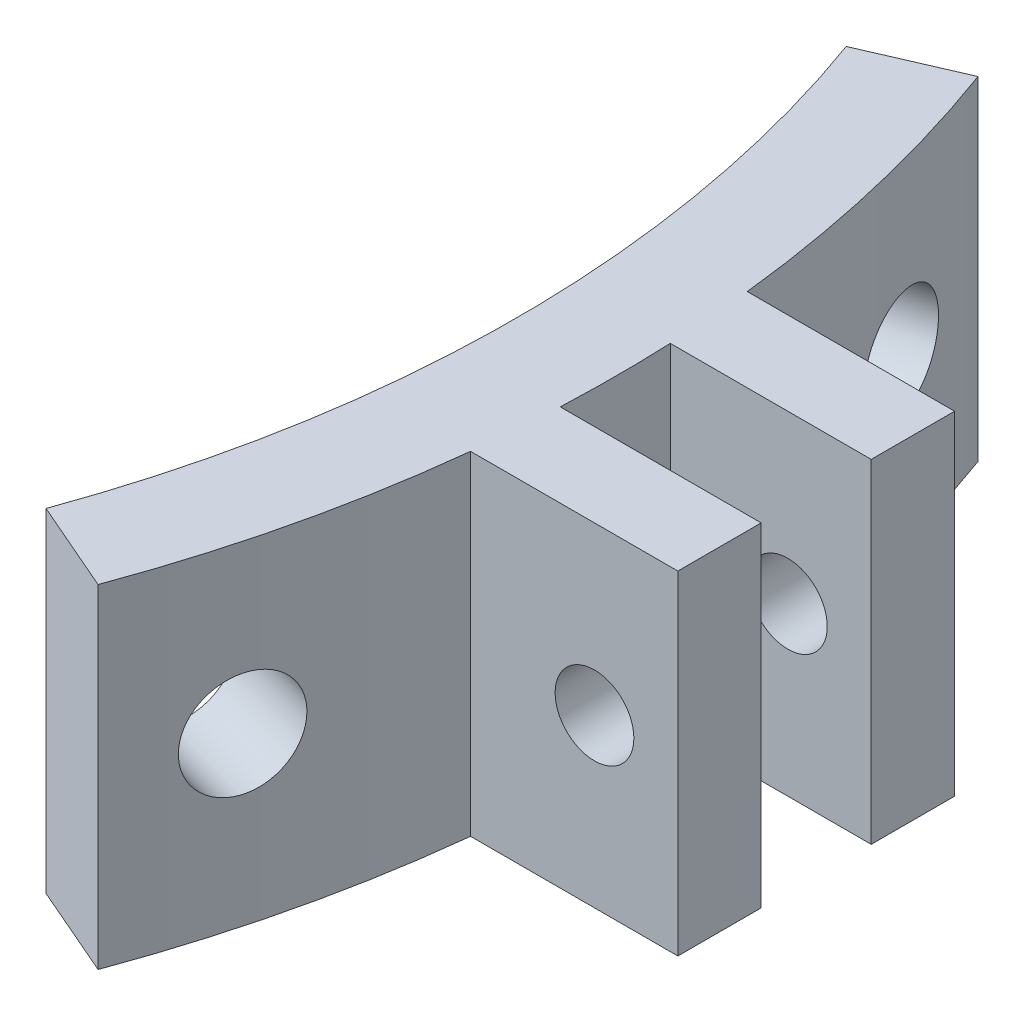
ISO-10303-21;
HEADER;
FILE_DESCRIPTION(('STEP AP214'),'2;1');
FILE_NAME('part.step','',(''),(''),'','','');
FILE_SCHEMA(('AUTOMOTIVE_DESIGN { 1 0 10303 214 1 1 1 1 }'));
ENDSEC;
DATA;
#1=APPLICATION_CONTEXT('core data for automotive mechanical design processes');
#2=APPLICATION_PROTOCOL_DEFINITION('international standard','automotive_design',2000,#1);
#3=PRODUCT_CONTEXT('',#1,'mechanical');
#4=PRODUCT('Part','Part','',(#3));
#5=PRODUCT_RELATED_PRODUCT_CATEGORY('part','',(#4));
#6=PRODUCT_DEFINITION_FORMATION('','',#4);
#7=PRODUCT_DEFINITION_CONTEXT('part definition',#1,'design');
#8=PRODUCT_DEFINITION('design','',#6,#7);
#9=PRODUCT_DEFINITION_SHAPE('','',#8);
#10=(LENGTH_UNIT() NAMED_UNIT(*) SI_UNIT(.MILLI.,.METRE.));
#11=(NAMED_UNIT(*) PLANE_ANGLE_UNIT() SI_UNIT($,.RADIAN.));
#12=(NAMED_UNIT(*) SI_UNIT($,.STERADIAN.) SOLID_ANGLE_UNIT());
#13=UNCERTAINTY_MEASURE_WITH_UNIT(LENGTH_MEASURE(1.E-05),#10,'distance_accuracy_value','');
#14=(GEOMETRIC_REPRESENTATION_CONTEXT(3) GLOBAL_UNCERTAINTY_ASSIGNED_CONTEXT((#13)) GLOBAL_UNIT_ASSIGNED_CONTEXT((#10,
#11,#12)) REPRESENTATION_CONTEXT('',''));
#15=CARTESIAN_POINT('',(0.,0.,0.));
#16=DIRECTION('',(0.,0.,1.));
#17=DIRECTION('',(1.,0.,0.));
#18=AXIS2_PLACEMENT_3D('',#15,#16,#17);
#19=CARTESIAN_POINT('',(0.,6.35,0.));
#20=DIRECTION('',(0.,-1.,0.));
#21=DIRECTION('',(0.,0.,-1.));
#22=AXIS2_PLACEMENT_3D('',#19,#20,#21);
#23=CYLINDRICAL_SURFACE('',#22,48.514);
#24=CARTESIAN_POINT('',(0.,-6.35,0.));
#25=DIRECTION('',(0.,1.,0.));
#26=DIRECTION('',(0.,0.,1.));
#27=AXIS2_PLACEMENT_3D('',#24,#25,#26);
#28=CIRCLE('',#27,48.514);
#29=CARTESIAN_POINT('',(48.2268600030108,-6.35,-5.2705));
#30=VERTEX_POINT('',#29);
#31=CARTESIAN_POINT('',(45.5277840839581,-6.35,-16.7579554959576));
#32=VERTEX_POINT('',#31);
#33=EDGE_CURVE('E155',#30,#32,#28,.T.);
#34=ORIENTED_EDGE('',*,*,#33,.T.);
#35=DIRECTION('',(0.,-1.,0.));
#36=VECTOR('',#35,1.);
#37=CARTESIAN_POINT('',(45.5277840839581,6.35,-16.7579554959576));
#38=LINE('',#37,#36);
#39=CARTESIAN_POINT('',(45.5277840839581,6.35,-16.7579554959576));
#40=VERTEX_POINT('',#39);
#41=EDGE_CURVE('E168',#32,#40,#38,.F.);
#42=ORIENTED_EDGE('',*,*,#41,.T.);
#43=CARTESIAN_POINT('',(0.,6.35,0.));
#44=DIRECTION('',(0.,1.,0.));
#45=DIRECTION('',(0.,0.,1.));
#46=AXIS2_PLACEMENT_3D('',#43,#44,#45);
#47=CIRCLE('',#46,48.514);
#48=CARTESIAN_POINT('',(48.2268600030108,6.35,-5.2705));
#49=VERTEX_POINT('',#48);
#50=EDGE_CURVE('E50',#49,#40,#47,.T.);
#51=ORIENTED_EDGE('',*,*,#50,.F.);
#52=DIRECTION('',(0.,-1.,0.));
#53=VECTOR('',#52,1.);
#54=CARTESIAN_POINT('',(48.2268600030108,6.35,-5.2705));
#55=LINE('',#54,#53);
#56=EDGE_CURVE('E170',#49,#30,#55,.T.);
#57=ORIENTED_EDGE('',*,*,#56,.T.);
#58=EDGE_LOOP('',(#34,#42,#51,#57));
#59=FACE_BOUND('',#58,.T.);
#60=CARTESIAN_POINT('',(46.3034500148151,0.,-14.4775243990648));
#61=CARTESIAN_POINT('',(46.3034518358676,0.11228965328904,-14.4775197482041));
#62=CARTESIAN_POINT('',(46.3062867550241,0.224659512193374,-14.468461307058));
#63=CARTESIAN_POINT('',(46.3175245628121,0.446300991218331,-14.4324445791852));
#64=CARTESIAN_POINT('',(46.3259340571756,0.555568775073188,-14.405465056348));
#65=CARTESIAN_POINT('',(46.3479868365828,0.767763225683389,-14.334353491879));
#66=CARTESIAN_POINT('',(46.3616275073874,0.87069303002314,-14.2902300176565));
#67=CARTESIAN_POINT('',(46.3936086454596,1.06731627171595,-14.1860574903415));
#68=CARTESIAN_POINT('',(46.4119479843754,1.16101191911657,-14.1260122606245));
#69=CARTESIAN_POINT('',(46.4526441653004,1.33660431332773,-13.9916033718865));
#70=CARTESIAN_POINT('',(46.4750035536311,1.41849352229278,-13.9172306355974));
#71=CARTESIAN_POINT('',(46.5229082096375,1.56808451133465,-13.7562438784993));
#72=CARTESIAN_POINT('',(46.5484536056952,1.63578571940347,-13.6696293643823));
#73=CARTESIAN_POINT('',(46.6018312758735,1.75509683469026,-13.4865340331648));
#74=CARTESIAN_POINT('',(46.6296643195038,1.80670129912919,-13.3900498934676));
#75=CARTESIAN_POINT('',(46.6866641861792,1.89231900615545,-13.1899354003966));
#76=CARTESIAN_POINT('',(46.7158310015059,1.92633235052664,-13.086305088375));
#77=CARTESIAN_POINT('',(46.7745427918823,1.97578356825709,-12.8748734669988));
#78=CARTESIAN_POINT('',(46.80408754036,1.99123208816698,-12.7670745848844));
#79=CARTESIAN_POINT('',(46.8626800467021,2.00314796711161,-12.5502995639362));
#80=CARTESIAN_POINT('',(46.8917278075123,1.99961543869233,-12.4413234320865));
#81=CARTESIAN_POINT('',(46.9484954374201,1.97367838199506,-12.2253602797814));
#82=CARTESIAN_POINT('',(46.9762161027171,1.95128532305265,-12.1183720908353));
#83=CARTESIAN_POINT('',(47.0296365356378,1.88828062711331,-11.9093713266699));
#84=CARTESIAN_POINT('',(47.0553362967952,1.84766893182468,-11.8073587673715));
#85=CARTESIAN_POINT('',(47.1041227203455,1.74936665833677,-11.611203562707));
#86=CARTESIAN_POINT('',(47.1272085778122,1.69167083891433,-11.5170633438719));
#87=CARTESIAN_POINT('',(47.1702728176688,1.56084193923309,-11.3393971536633));
#88=CARTESIAN_POINT('',(47.1902511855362,1.48770878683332,-11.2558712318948));
#89=CARTESIAN_POINT('',(47.226737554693,1.32801632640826,-11.1017901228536));
#90=CARTESIAN_POINT('',(47.2432429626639,1.24144706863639,-11.0312446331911));
#91=CARTESIAN_POINT('',(47.2724852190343,1.05737479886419,-10.9052525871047));
#92=CARTESIAN_POINT('',(47.2852220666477,0.959871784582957,-10.8498060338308));
#93=CARTESIAN_POINT('',(47.3067324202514,0.756693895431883,-10.7556314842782));
#94=CARTESIAN_POINT('',(47.3155058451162,0.651018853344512,-10.7169038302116));
#95=CARTESIAN_POINT('',(47.328965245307,0.434499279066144,-10.657306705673));
#96=CARTESIAN_POINT('',(47.3336512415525,0.323654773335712,-10.6364371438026));
#97=CARTESIAN_POINT('',(47.3388715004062,0.100030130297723,-10.6131798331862));
#98=CARTESIAN_POINT('',(47.339408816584,-0.0127485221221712,-10.6107784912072));
#99=CARTESIAN_POINT('',(47.3363327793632,-0.237116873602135,-10.6244925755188));
#100=CARTESIAN_POINT('',(47.3327194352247,-0.348706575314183,-10.6406079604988));
#101=CARTESIAN_POINT('',(47.3213916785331,-0.56749043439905,-10.6908719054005));
#102=CARTESIAN_POINT('',(47.3136786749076,-0.674686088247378,-10.7250142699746));
#103=CARTESIAN_POINT('',(47.2942590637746,-0.881684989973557,-10.8103264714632));
#104=CARTESIAN_POINT('',(47.2825524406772,-0.981488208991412,-10.8614963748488));
#105=CARTESIAN_POINT('',(47.2553122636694,-1.17093327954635,-10.9794038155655));
#106=CARTESIAN_POINT('',(47.2397764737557,-1.26056914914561,-11.0461504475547));
#107=CARTESIAN_POINT('',(47.2051370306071,-1.42707495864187,-11.1932537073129));
#108=CARTESIAN_POINT('',(47.1860333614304,-1.50394484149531,-11.2736103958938));
#109=CARTESIAN_POINT('',(47.1445955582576,-1.6427832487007,-11.445659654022));
#110=CARTESIAN_POINT('',(47.1222594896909,-1.70474278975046,-11.537359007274));
#111=CARTESIAN_POINT('',(47.0748228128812,-1.81194031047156,-11.7294084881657));
#112=CARTESIAN_POINT('',(47.0497222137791,-1.85717834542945,-11.8297585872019));
#113=CARTESIAN_POINT('',(46.9973364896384,-1.92963296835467,-12.0361906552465));
#114=CARTESIAN_POINT('',(46.9700520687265,-1.95685533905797,-12.142270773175));
#115=CARTESIAN_POINT('',(46.913977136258,-1.99252483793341,-12.357154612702));
#116=CARTESIAN_POINT('',(46.8851866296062,-2.00097202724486,-12.4659583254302));
#117=CARTESIAN_POINT('',(46.8269113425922,-1.9988507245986,-12.6831068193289));
#118=CARTESIAN_POINT('',(46.7974270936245,-1.98829634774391,-12.7914518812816));
#119=CARTESIAN_POINT('',(46.7386163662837,-1.94850063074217,-13.0046981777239));
#120=CARTESIAN_POINT('',(46.7092898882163,-1.91925925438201,-13.1095994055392));
#121=CARTESIAN_POINT('',(46.6517219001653,-1.8429221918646,-13.3130095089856));
#122=CARTESIAN_POINT('',(46.6234804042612,-1.79582627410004,-13.4115183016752));
#123=CARTESIAN_POINT('',(46.5690284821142,-1.68512010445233,-13.599388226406));
#124=CARTESIAN_POINT('',(46.5428179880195,-1.62151040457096,-13.6887496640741));
#125=CARTESIAN_POINT('',(46.4933305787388,-1.47953412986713,-13.8559021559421));
#126=CARTESIAN_POINT('',(46.4700555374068,-1.40115820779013,-13.9336858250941));
#127=CARTESIAN_POINT('',(46.4273036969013,-1.23187120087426,-14.0754810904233));
#128=CARTESIAN_POINT('',(46.4078278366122,-1.14095702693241,-14.1394892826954));
#129=CARTESIAN_POINT('',(46.3734036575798,-0.949120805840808,-14.2519859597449));
#130=CARTESIAN_POINT('',(46.3584589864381,-0.848190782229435,-14.3004619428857));
#131=CARTESIAN_POINT('',(46.3337119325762,-0.639321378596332,-14.3804417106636));
#132=CARTESIAN_POINT('',(46.3239034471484,-0.531390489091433,-14.4119656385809));
#133=CARTESIAN_POINT('',(46.3124035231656,-0.352319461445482,-14.4488644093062));
#134=CARTESIAN_POINT('',(46.3090515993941,-0.282340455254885,-14.4595986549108));
#135=CARTESIAN_POINT('',(46.3045742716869,-0.14158493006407,-14.4739301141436));
#136=CARTESIAN_POINT('',(46.3034488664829,-0.0708084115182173,-14.4775273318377));
#137=CARTESIAN_POINT('',(46.3034500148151,0.,-14.4775243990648));
#138=B_SPLINE_CURVE_WITH_KNOTS('',3,(#60,#61,#62,#63,#64,#65,#66,#67,#68,#69,#70,#71,#72,#73,
#74,#75,#76,#77,#78,#79,#80,#81,#82,#83,#84,#85,#86,#87,#88,#89,#90,#91,#92,#93,#94,#95,#96,#97,
#98,#99,#100,#101,#102,#103,#104,#105,#106,#107,#108,#109,#110,#111,#112,#113,#114,#115,#116,
#117,#118,#119,#120,#121,#122,#123,#124,#125,#126,#127,#128,#129,#130,#131,#132,#133,#134,#135,
#136,#137),.UNSPECIFIED.,.T.,.F.,(4,2,2,2,2,2,2,2,2,2,2,2,2,2,2,2,2,2,2,2,2,2,2,2,2,2,2,2,2,2,2,
2,2,2,2,2,2,2,4),(0.,0.336610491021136,0.673620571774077,1.01046245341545,1.34722352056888,
1.68419865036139,2.02118736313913,2.35828989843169,2.69539048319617,3.03229765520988,
3.36920282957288,3.70590327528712,4.0426047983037,4.37940972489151,4.7162162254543,
5.05327333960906,5.39033052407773,5.72739460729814,6.06445696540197,6.40127121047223,
6.73808470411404,7.07478252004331,7.41148165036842,7.74837786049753,8.08527557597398,
8.42237576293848,8.75947483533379,9.09646565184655,9.43345537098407,9.77019486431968,
10.1069350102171,10.4436795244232,10.7804127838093,11.117359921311,11.4543902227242,
11.791691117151,12.1285903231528,12.3408526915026,12.5531149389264),.UNSPECIFIED.);
#139=CARTESIAN_POINT('',(46.3034500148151,0.,-14.4775243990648));
#140=VERTEX_POINT('',#139);
#141=EDGE_CURVE('E493',#140,#140,#138,.T.);
#142=ORIENTED_EDGE('',*,*,#141,.F.);
#143=EDGE_LOOP('',(#142));
#144=FACE_BOUND('',#143,.T.);
#145=ADVANCED_FACE('F41',(#59,#144),#23,.T.);
#146=CARTESIAN_POINT('',(0.,6.35,0.));
#147=DIRECTION('',(0.,-1.,0.));
#148=DIRECTION('',(0.,0.,-1.));
#149=AXIS2_PLACEMENT_3D('',#146,#147,#148);
#150=CYLINDRICAL_SURFACE('',#149,44.704);
#151=DIRECTION('',(0.,1.,0.));
#152=VECTOR('',#151,1.);
#153=CARTESIAN_POINT('',(42.0260635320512,-6.35,15.24));
#154=LINE('',#153,#152);
#155=CARTESIAN_POINT('',(42.0260635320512,-6.35,15.24));
#156=VERTEX_POINT('',#155);
#157=CARTESIAN_POINT('',(42.0260635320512,6.35,15.24));
#158=VERTEX_POINT('',#157);
#159=EDGE_CURVE('E139',#156,#158,#154,.T.);
#160=ORIENTED_EDGE('',*,*,#159,.T.);
#161=CARTESIAN_POINT('',(0.,6.35,0.));
#162=DIRECTION('',(0.,1.,0.));
#163=DIRECTION('',(0.,0.,1.));
#164=AXIS2_PLACEMENT_3D('',#161,#162,#163);
#165=CIRCLE('',#164,44.704);
#166=CARTESIAN_POINT('',(42.0260635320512,6.35,-15.24));
#167=VERTEX_POINT('',#166);
#168=EDGE_CURVE('E146',#158,#167,#165,.T.);
#169=ORIENTED_EDGE('',*,*,#168,.T.);
#170=DIRECTION('',(0.,1.,0.));
#171=VECTOR('',#170,1.);
#172=CARTESIAN_POINT('',(42.0260635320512,-6.35,-15.24));
#173=LINE('',#172,#171);
#174=CARTESIAN_POINT('',(42.0260635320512,-6.35,-15.24));
#175=VERTEX_POINT('',#174);
#176=EDGE_CURVE('E130',#175,#167,#173,.T.);
#177=ORIENTED_EDGE('',*,*,#176,.F.);
#178=CARTESIAN_POINT('',(0.,-6.35,0.));
#179=DIRECTION('',(0.,1.,0.));
#180=DIRECTION('',(0.,0.,1.));
#181=AXIS2_PLACEMENT_3D('',#178,#179,#180);
#182=CIRCLE('',#181,44.704);
#183=EDGE_CURVE('E153',#156,#175,#182,.T.);
#184=ORIENTED_EDGE('',*,*,#183,.F.);
#185=EDGE_LOOP('',(#160,#169,#177,#184));
#186=FACE_BOUND('',#185,.T.);
#187=CARTESIAN_POINT('',(43.6551502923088,0.,9.62680990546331));
#188=CARTESIAN_POINT('',(43.655149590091,0.112280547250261,9.626814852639));
#189=CARTESIAN_POINT('',(43.6531082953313,0.224641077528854,9.63608435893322));
#190=CARTESIAN_POINT('',(43.644959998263,0.446263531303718,9.67292225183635));
#191=CARTESIAN_POINT('',(43.6388481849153,0.555521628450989,9.70051229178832));
#192=CARTESIAN_POINT('',(43.6226325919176,0.767696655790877,9.77317345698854));
#193=CARTESIAN_POINT('',(43.6125308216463,0.870616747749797,9.81823578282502));
#194=CARTESIAN_POINT('',(43.5884700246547,1.06722248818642,9.92450757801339));
#195=CARTESIAN_POINT('',(43.5745119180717,1.16091033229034,9.9857131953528));
#196=CARTESIAN_POINT('',(43.542929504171,1.33649891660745,10.1225404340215));
#197=CARTESIAN_POINT('',(43.5253025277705,1.41839100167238,10.1981725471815));
#198=CARTESIAN_POINT('',(43.4866794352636,1.56798983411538,10.3616294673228));
#199=CARTESIAN_POINT('',(43.4656831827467,1.6356960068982,10.4494547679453));
#200=CARTESIAN_POINT('',(43.4207078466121,1.75502308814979,10.634793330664));
#201=CARTESIAN_POINT('',(43.3967275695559,1.80663753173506,10.732310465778));
#202=CARTESIAN_POINT('',(43.3463019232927,1.89227443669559,10.9341912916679));
#203=CARTESIAN_POINT('',(43.3198565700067,1.92629701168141,11.0385549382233));
#204=CARTESIAN_POINT('',(43.2651510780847,1.97576229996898,11.2510595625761));
#205=CARTESIAN_POINT('',(43.2368921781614,1.99121755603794,11.3591979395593));
#206=CARTESIAN_POINT('',(43.1792904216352,2.00314818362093,11.5762298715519));
#207=CARTESIAN_POINT('',(43.1499475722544,1.99962368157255,11.6851234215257));
#208=CARTESIAN_POINT('',(43.0910462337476,1.97370528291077,11.9004961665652));
#209=CARTESIAN_POINT('',(43.0614879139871,1.95132489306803,12.0069770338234));
#210=CARTESIAN_POINT('',(43.0030538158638,1.88835094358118,12.2146067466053));
#211=CARTESIAN_POINT('',(42.9741780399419,1.84775731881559,12.3157555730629));
#212=CARTESIAN_POINT('',(42.9180558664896,1.74949376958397,12.5099290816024));
#213=CARTESIAN_POINT('',(42.8908100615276,1.69181767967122,12.6029508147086));
#214=CARTESIAN_POINT('',(42.8389121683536,1.56103092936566,12.7782467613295));
#215=CARTESIAN_POINT('',(42.8142600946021,1.48792018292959,12.8605209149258));
#216=CARTESIAN_POINT('',(42.7684314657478,1.3282630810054,13.0121165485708));
#217=CARTESIAN_POINT('',(42.7472579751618,1.24170500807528,13.0814266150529));
#218=CARTESIAN_POINT('',(42.7092180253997,1.05765152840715,13.2050941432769));
#219=CARTESIAN_POINT('',(42.6923515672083,0.96015611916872,13.2594516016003));
#220=CARTESIAN_POINT('',(42.6635860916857,0.756988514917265,13.3517184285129));
#221=CARTESIAN_POINT('',(42.6516871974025,0.651316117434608,13.3896273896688));
#222=CARTESIAN_POINT('',(42.6333342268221,0.434797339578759,13.4479504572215));
#223=CARTESIAN_POINT('',(42.6268801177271,0.323950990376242,13.468364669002));
#224=CARTESIAN_POINT('',(42.6196819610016,0.100333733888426,13.4911256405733));
#225=CARTESIAN_POINT('',(42.618932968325,-0.0124354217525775,13.4934880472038));
#226=CARTESIAN_POINT('',(42.6231625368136,-0.236787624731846,13.4801216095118));
#227=CARTESIAN_POINT('',(42.628141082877,-0.348370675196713,13.4643928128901));
#228=CARTESIAN_POINT('',(42.6436201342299,-0.56713728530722,13.4152872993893));
#229=CARTESIAN_POINT('',(42.6541184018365,-0.674322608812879,13.3819177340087));
#230=CARTESIAN_POINT('',(42.6802141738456,-0.881305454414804,13.2984523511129));
#231=CARTESIAN_POINT('',(42.6958117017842,-0.981102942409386,13.248356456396));
#232=CARTESIAN_POINT('',(42.7315047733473,-1.17055268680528,13.1327743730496));
#233=CARTESIAN_POINT('',(42.7516034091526,-1.26019790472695,13.0672776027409));
#234=CARTESIAN_POINT('',(42.7955226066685,-1.42672764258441,12.9227145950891));
#235=CARTESIAN_POINT('',(42.8193431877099,-1.50361209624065,12.8436482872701));
#236=CARTESIAN_POINT('',(42.8698430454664,-1.64249281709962,12.6740676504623));
#237=CARTESIAN_POINT('',(42.8965243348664,-1.7044785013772,12.5835452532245));
#238=CARTESIAN_POINT('',(42.9517844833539,-1.81172980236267,12.3936110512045));
#239=CARTESIAN_POINT('',(42.980363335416,-1.85699548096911,12.294199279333));
#240=CARTESIAN_POINT('',(43.0384437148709,-1.92950331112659,12.0893053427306));
#241=CARTESIAN_POINT('',(43.0679448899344,-1.95675225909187,11.9838254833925));
#242=CARTESIAN_POINT('',(43.1269445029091,-1.99247539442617,11.7697322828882));
#243=CARTESIAN_POINT('',(43.1564429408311,-2.00094965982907,11.6611189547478));
#244=CARTESIAN_POINT('',(43.2145413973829,-1.99888209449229,11.4439352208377));
#245=CARTESIAN_POINT('',(43.2431421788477,-1.98835688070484,11.335364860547));
#246=CARTESIAN_POINT('',(43.2986988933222,-1.94862343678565,11.1212646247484));
#247=CARTESIAN_POINT('',(43.3256548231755,-1.91941517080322,11.0157347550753));
#248=CARTESIAN_POINT('',(43.3772613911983,-1.84314794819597,10.8107350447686));
#249=CARTESIAN_POINT('',(43.4019120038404,-1.7960887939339,10.7112652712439));
#250=CARTESIAN_POINT('',(43.4483663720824,-1.68545891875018,10.5212477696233));
#251=CARTESIAN_POINT('',(43.4701702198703,-1.62188873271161,10.4306997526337));
#252=CARTESIAN_POINT('',(43.5105242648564,-1.47998328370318,10.2610679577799));
#253=CARTESIAN_POINT('',(43.5290719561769,-1.40163674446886,10.1819930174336));
#254=CARTESIAN_POINT('',(43.562580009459,-1.23240418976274,10.0376662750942));
#255=CARTESIAN_POINT('',(43.5775394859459,-1.14151508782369,9.97241788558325));
#256=CARTESIAN_POINT('',(43.6036503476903,-0.949717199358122,9.85762505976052));
#257=CARTESIAN_POINT('',(43.6147984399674,-0.848799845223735,9.80809420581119));
#258=CARTESIAN_POINT('',(43.6331091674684,-0.639947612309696,9.72631344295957));
#259=CARTESIAN_POINT('',(43.6402765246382,-0.532021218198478,9.69404306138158));
#260=CARTESIAN_POINT('',(43.6486560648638,-0.352850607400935,9.65622327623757));
#261=CARTESIAN_POINT('',(43.6510898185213,-0.282767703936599,9.64520768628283));
#262=CARTESIAN_POINT('',(43.6543371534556,-0.141800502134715,9.63049944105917));
#263=CARTESIAN_POINT('',(43.6551507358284,-0.0709162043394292,9.62680678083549));
#264=CARTESIAN_POINT('',(43.6551502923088,0.,9.62680990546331));
#265=B_SPLINE_CURVE_WITH_KNOTS('',3,(#187,#188,#189,#190,#191,#192,#193,#194,#195,#196,#197,
#198,#199,#200,#201,#202,#203,#204,#205,#206,#207,#208,#209,#210,#211,#212,#213,#214,#215,#216,
#217,#218,#219,#220,#221,#222,#223,#224,#225,#226,#227,#228,#229,#230,#231,#232,#233,#234,#235,
#236,#237,#238,#239,#240,#241,#242,#243,#244,#245,#246,#247,#248,#249,#250,#251,#252,#253,#254,
#255,#256,#257,#258,#259,#260,#261,#262,#263,#264),.UNSPECIFIED.,.T.,.F.,(4,2,2,2,2,2,2,2,2,2,2,
2,2,2,2,2,2,2,2,2,2,2,2,2,2,2,2,2,2,2,2,2,2,2,2,2,2,2,4),(0.,0.336582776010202,
0.673564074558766,1.01037588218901,1.34710739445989,1.68408473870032,2.02107572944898,
2.35820193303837,2.69532595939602,3.03222212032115,3.36911603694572,3.70576883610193,
4.04242283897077,4.37919849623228,4.7159760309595,5.05304868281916,5.39012141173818,
5.72720248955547,6.06428153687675,6.40106837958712,6.73785433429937,7.0745038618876,
7.41115494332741,7.74803801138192,8.08492282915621,8.42204624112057,8.75916840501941,
9.09616332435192,9.43315684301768,9.76985576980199,10.1065553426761,10.44325864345,
10.7799510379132,11.1169014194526,11.4539348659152,11.7912587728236,12.1281816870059,
12.3407669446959,12.5533520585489),.UNSPECIFIED.);
#266=CARTESIAN_POINT('',(43.6551502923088,0.,9.62680990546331));
#267=VERTEX_POINT('',#266);
#268=EDGE_CURVE('E499',#267,#267,#265,.T.);
#269=ORIENTED_EDGE('',*,*,#268,.T.);
#270=EDGE_LOOP('',(#269));
#271=FACE_BOUND('',#270,.T.);
#272=CARTESIAN_POINT('',(42.6198741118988,0.,-13.4905132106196));
#273=CARTESIAN_POINT('',(42.6198759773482,-0.112280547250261,-13.4905085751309));
#274=CARTESIAN_POINT('',(42.6227429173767,-0.224641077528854,-13.4814602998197));
#275=CARTESIAN_POINT('',(42.6341052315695,-0.446263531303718,-13.4454836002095));
#276=CARTESIAN_POINT('',(42.6426072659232,-0.55552162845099,-13.4185340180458));
#277=CARTESIAN_POINT('',(42.6648947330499,-0.767696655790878,-13.347499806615));
#278=CARTESIAN_POINT('',(42.67867750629,-0.870616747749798,-13.3034238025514));
#279=CARTESIAN_POINT('',(42.7109761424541,-1.06722248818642,-13.1993593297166));
#280=CARTESIAN_POINT('',(42.7294908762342,-1.16091033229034,-13.1393746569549));
#281=CARTESIAN_POINT('',(42.7705533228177,-1.33649891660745,-13.0050875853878));
#282=CARTESIAN_POINT('',(42.793103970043,-1.41839100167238,-12.930774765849));
#283=CARTESIAN_POINT('',(42.84138385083,-1.56798983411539,-12.7699053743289));
#284=CARTESIAN_POINT('',(42.8671132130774,-1.6356960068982,-12.6833483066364));
#285=CARTESIAN_POINT('',(42.9208327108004,-1.75502308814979,-12.5003527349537));
#286=CARTESIAN_POINT('',(42.9488237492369,-1.80663753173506,-12.4039102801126));
#287=CARTESIAN_POINT('',(43.0060942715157,-1.89227443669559,-12.2038635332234));
#288=CARTESIAN_POINT('',(43.0353737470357,-1.92629701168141,-12.1002592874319));
#289=CARTESIAN_POINT('',(43.094249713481,-1.97576229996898,-11.8888721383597));
#290=CARTESIAN_POINT('',(43.1238459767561,-1.99121755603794,-11.7810921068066));
#291=CARTESIAN_POINT('',(43.1824773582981,-2.00314818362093,-11.5643360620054));
#292=CARTESIAN_POINT('',(43.2115124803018,-1.99962368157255,-11.4553600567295));
#293=CARTESIAN_POINT('',(43.2681887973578,-1.97370528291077,-11.239391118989));
#294=CARTESIAN_POINT('',(43.2958309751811,-1.95132489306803,-11.1323968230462));
#295=CARTESIAN_POINT('',(43.34904041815,-1.88835094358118,-10.9233671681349));
#296=CARTESIAN_POINT('',(43.3746076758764,-1.84775731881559,-10.8213318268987));
#297=CARTESIAN_POINT('',(43.423091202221,-1.74949376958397,-10.6251115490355));
#298=CARTESIAN_POINT('',(43.4460065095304,-1.69181767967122,-10.5309294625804));
#299=CARTESIAN_POINT('',(43.4887095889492,-1.56103092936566,-10.3531697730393));
#300=CARTESIAN_POINT('',(43.5084973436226,-1.48792018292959,-10.2695922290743));
#301=CARTESIAN_POINT('',(43.5446064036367,-1.3282630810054,-10.1153922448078));
#302=CARTESIAN_POINT('',(43.5609246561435,-1.24170500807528,-10.0447812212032));
#303=CARTESIAN_POINT('',(43.5898148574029,-1.05765152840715,-9.91866202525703));
#304=CARTESIAN_POINT('',(43.602386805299,-0.960156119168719,-9.86315385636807));
#305=CARTESIAN_POINT('',(43.6236085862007,-0.756988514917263,-9.76886570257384));
#306=CARTESIAN_POINT('',(43.6322583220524,-0.651316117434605,-9.73008613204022));
#307=CARTESIAN_POINT('',(43.6455257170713,-0.434797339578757,-9.67040038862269));
#308=CARTESIAN_POINT('',(43.6501434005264,-0.323950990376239,-9.6494941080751));
#309=CARTESIAN_POINT('',(43.6552900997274,-0.100333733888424,-9.62618345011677));
#310=CARTESIAN_POINT('',(43.6558226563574,0.0124354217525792,-9.62376304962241));
#311=CARTESIAN_POINT('',(43.6528023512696,0.236787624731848,-9.63745350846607));
#312=CARTESIAN_POINT('',(43.6492495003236,0.348370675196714,-9.65356431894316));
#313=CARTESIAN_POINT('',(43.6381019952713,0.567137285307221,-9.70383046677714));
#314=CARTESIAN_POINT('',(43.6305089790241,0.674322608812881,-9.73797849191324));
#315=CARTESIAN_POINT('',(43.6113758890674,0.881305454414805,-9.82330951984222));
#316=CARTESIAN_POINT('',(43.59983579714,0.981102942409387,-9.87449260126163));
#317=CARTESIAN_POINT('',(43.5729558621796,1.17055268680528,-9.99243615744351));
#318=CARTESIAN_POINT('',(43.557613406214,1.26019790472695,-10.0592073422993));
#319=CARTESIAN_POINT('',(43.5233670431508,1.42672764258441,-10.2063621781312));
#320=CARTESIAN_POINT('',(43.5044631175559,1.50361209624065,-10.2867458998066));
#321=CARTESIAN_POINT('',(43.4634069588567,1.64249281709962,-10.4588569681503));
#322=CARTESIAN_POINT('',(43.4412524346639,1.7044785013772,-10.5505923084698));
#323=CARTESIAN_POINT('',(43.394142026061,1.81172980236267,-10.7427102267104));
#324=CARTESIAN_POINT('',(43.369186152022,1.85699548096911,-10.8430927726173));
#325=CARTESIAN_POINT('',(43.3170382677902,1.92950331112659,-11.0495763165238));
#326=CARTESIAN_POINT('',(43.2898471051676,1.95675225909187,-11.1556751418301));
#327=CARTESIAN_POINT('',(43.233895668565,1.99247539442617,-11.3705850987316));
#328=CARTESIAN_POINT('',(43.2051354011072,2.00094965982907,-11.4793962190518));
#329=CARTESIAN_POINT('',(43.1468582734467,1.99888209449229,-11.6965320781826));
#330=CARTESIAN_POINT('',(43.117342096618,1.98835688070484,-11.8048571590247));
#331=CARTESIAN_POINT('',(43.0584055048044,1.94862343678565,-12.0180517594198));
#332=CARTESIAN_POINT('',(43.0289850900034,1.91941517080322,-12.1229212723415));
#333=CARTESIAN_POINT('',(42.9711778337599,1.84314794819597,-12.3262595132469));
#334=CARTESIAN_POINT('',(42.9427910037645,1.7960887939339,-12.424728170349));
#335=CARTESIAN_POINT('',(42.8880129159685,1.68545891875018,-12.6125153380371));
#336=CARTESIAN_POINT('',(42.8616215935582,1.62188873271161,-12.7018341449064));
#337=CARTESIAN_POINT('',(42.8117533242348,1.47998328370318,-12.8689166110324));
#338=CARTESIAN_POINT('',(42.7882786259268,1.40163674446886,-12.9466713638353));
#339=CARTESIAN_POINT('',(42.7451340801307,1.23240418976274,-13.0884160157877));
#340=CARTESIAN_POINT('',(42.7254651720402,1.14151508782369,-13.1524025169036));
#341=CARTESIAN_POINT('',(42.6906814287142,0.949717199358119,-13.2648714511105));
#342=CARTESIAN_POINT('',(42.6755705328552,0.848799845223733,-13.3133404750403));
#343=CARTESIAN_POINT('',(42.6505377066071,0.639947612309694,-13.3933200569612));
#344=CARTESIAN_POINT('',(42.6406096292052,0.532021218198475,-13.4248507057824));
#345=CARTESIAN_POINT('',(42.6289566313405,0.352850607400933,-13.4617933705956));
#346=CARTESIAN_POINT('',(42.6255565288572,0.282767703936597,-13.4725500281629));
#347=CARTESIAN_POINT('',(42.6210146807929,0.141800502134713,-13.4869114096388));
#348=CARTESIAN_POINT('',(42.6198729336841,0.0709162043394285,-13.4905161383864));
#349=CARTESIAN_POINT('',(42.6198741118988,0.,-13.4905132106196));
#350=B_SPLINE_CURVE_WITH_KNOTS('',3,(#272,#273,#274,#275,#276,#277,#278,#279,#280,#281,#282,
#283,#284,#285,#286,#287,#288,#289,#290,#291,#292,#293,#294,#295,#296,#297,#298,#299,#300,#301,
#302,#303,#304,#305,#306,#307,#308,#309,#310,#311,#312,#313,#314,#315,#316,#317,#318,#319,#320,
#321,#322,#323,#324,#325,#326,#327,#328,#329,#330,#331,#332,#333,#334,#335,#336,#337,#338,#339,
#340,#341,#342,#343,#344,#345,#346,#347,#348,#349),.UNSPECIFIED.,.T.,.F.,(4,2,2,2,2,2,2,2,2,2,2,
2,2,2,2,2,2,2,2,2,2,2,2,2,2,2,2,2,2,2,2,2,2,2,2,2,2,2,4),(0.,0.336582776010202,
0.673564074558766,1.01037588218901,1.34710739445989,1.68408473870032,2.02107572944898,
2.35820193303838,2.69532595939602,3.03222212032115,3.36911603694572,3.70576883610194,
4.04242283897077,4.37919849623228,4.7159760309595,5.05304868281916,5.39012141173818,
5.72720248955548,6.06428153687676,6.40106837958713,6.73785433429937,7.07450386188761,
7.41115494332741,7.74803801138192,8.08492282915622,8.42204624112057,8.75916840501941,
9.09616332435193,9.43315684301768,9.76985576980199,10.1065553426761,10.44325864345,
10.7799510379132,11.1169014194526,11.4539348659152,11.7912587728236,12.1281816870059,
12.3407669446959,12.5533520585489),.UNSPECIFIED.);
#351=CARTESIAN_POINT('',(42.6198741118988,0.,-13.4905132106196));
#352=VERTEX_POINT('',#351);
#353=EDGE_CURVE('E488',#352,#352,#350,.T.);
#354=ORIENTED_EDGE('',*,*,#353,.F.);
#355=EDGE_LOOP('',(#354));
#356=FACE_BOUND('',#355,.T.);
#357=ADVANCED_FACE('F150',(#186,#271,#356),#150,.F.);
#358=CARTESIAN_POINT('',(47.3387261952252,0.,10.6138210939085));
#359=CARTESIAN_POINT('',(47.3387254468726,-0.11228965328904,10.6138260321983));
#360=CARTESIAN_POINT('',(47.3366513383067,-0.224659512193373,10.6230883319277));
#361=CARTESIAN_POINT('',(47.3283752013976,-0.446300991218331,10.6598986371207));
#362=CARTESIAN_POINT('',(47.3221682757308,-0.555568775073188,10.6874683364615));
#363=CARTESIAN_POINT('',(47.3057107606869,-0.767763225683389,10.760079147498));
#364=CARTESIAN_POINT('',(47.2954621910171,-0.870693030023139,10.8051115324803));
#365=CARTESIAN_POINT('',(47.2710724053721,-1.06731627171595,10.9113181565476));
#366=CARTESIAN_POINT('',(47.2569321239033,-1.16101191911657,10.9724885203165));
#367=CARTESIAN_POINT('',(47.2249716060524,-1.33660431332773,11.1092381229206));
#368=CARTESIAN_POINT('',(47.2071490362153,-1.41849352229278,11.1848264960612));
#369=CARTESIAN_POINT('',(47.1681423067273,-1.56808451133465,11.3481974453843));
#370=CARTESIAN_POINT('',(47.1469580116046,-1.63578571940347,11.4359805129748));
#371=CARTESIAN_POINT('',(47.101636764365,-1.75509683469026,11.6212345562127));
#372=CARTESIAN_POINT('',(47.0774988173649,-1.80670129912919,11.7187087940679));
#373=CARTESIAN_POINT('',(47.0268049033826,-1.89231900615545,11.9205129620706));
#374=CARTESIAN_POINT('',(47.0002489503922,-1.92633235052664,12.0248428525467));
#375=CARTESIAN_POINT('',(46.9453790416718,-1.97578356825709,12.23730390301));
#376=CARTESIAN_POINT('',(46.9170661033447,-1.99123208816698,12.3454328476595));
#377=CARTESIAN_POINT('',(46.8594211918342,-2.00314796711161,12.5624617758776));
#378=CARTESIAN_POINT('',(46.8300892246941,-1.99961543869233,12.6713617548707));
#379=CARTESIAN_POINT('',(46.7712698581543,-1.97367838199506,12.8867751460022));
#380=CARTESIAN_POINT('',(46.7417825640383,-1.95128532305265,12.9932899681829));
#381=CARTESIAN_POINT('',(46.683545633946,-1.88828062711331,13.2010001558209));
#382=CARTESIAN_POINT('',(46.6547960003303,-1.84766893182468,13.302195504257));
#383=CARTESIAN_POINT('',(46.5989686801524,-1.74936665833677,13.4964641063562));
#384=CARTESIAN_POINT('',(46.5718915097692,-1.69167083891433,13.5895348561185));
#385=CARTESIAN_POINT('',(46.5203531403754,-1.56084193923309,13.7649304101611));
#386=CARTESIAN_POINT('',(46.4958919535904,-1.48770878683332,13.8472551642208));
#387=CARTESIAN_POINT('',(46.4504495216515,-1.32801632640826,13.9989365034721));
#388=CARTESIAN_POINT('',(46.4294708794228,-1.24144706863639,14.0682833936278));
#389=CARTESIAN_POINT('',(46.3917993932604,-1.05737479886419,14.1920168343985));
#390=CARTESIAN_POINT('',(46.3751065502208,-0.959871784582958,14.2464033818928));
#391=CARTESIAN_POINT('',(46.3466477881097,-0.756693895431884,14.3387161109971));
#392=CARTESIAN_POINT('',(46.3348819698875,-0.651018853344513,14.3766419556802));
#393=CARTESIAN_POINT('',(46.3167395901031,-0.434499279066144,14.4349842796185));
#394=CARTESIAN_POINT('',(46.3103630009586,-0.323654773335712,14.4554008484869));
#395=CARTESIAN_POINT('',(46.303255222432,-0.100030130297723,14.4781523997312));
#396=CARTESIAN_POINT('',(46.3025198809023,0.012748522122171,14.4805006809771));
#397=CARTESIAN_POINT('',(46.306712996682,0.237116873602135,14.4670859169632));
#398=CARTESIAN_POINT('',(46.3116414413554,0.348706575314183,14.4513229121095));
#399=CARTESIAN_POINT('',(46.3269632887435,0.56749043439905,14.4021291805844));
#400=CARTESIAN_POINT('',(46.3373548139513,0.674686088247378,14.3687045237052));
#401=CARTESIAN_POINT('',(46.3631930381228,0.881684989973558,14.2851121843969));
#402=CARTESIAN_POINT('',(46.3786397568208,0.981488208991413,14.2349444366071));
#403=CARTESIAN_POINT('',(46.4140027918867,1.17093327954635,14.1192135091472));
#404=CARTESIAN_POINT('',(46.4339217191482,1.26056914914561,14.0536413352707));
#405=CARTESIAN_POINT('',(46.4774747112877,1.42707495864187,13.9089264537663));
#406=CARTESIAN_POINT('',(46.5011087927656,1.50394484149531,13.8297836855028));
#407=CARTESIAN_POINT('',(46.5512472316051,1.6427832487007,13.6600657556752));
#408=CARTESIAN_POINT('',(46.5777533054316,1.70474278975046,13.569483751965));
#409=CARTESIAN_POINT('',(46.6326966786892,1.81194031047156,13.3794456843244));
#410=CARTESIAN_POINT('',(46.6611339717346,1.85717834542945,13.2799896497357));
#411=CARTESIAN_POINT('',(46.7189826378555,1.92963296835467,13.0750213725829));
#412=CARTESIAN_POINT('',(46.7483936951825,1.95685533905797,12.9695110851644));
#413=CARTESIAN_POINT('',(46.8072732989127,1.99252483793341,12.7553787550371));
#414=CARTESIAN_POINT('',(46.8367418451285,2.00097202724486,12.6467567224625));
#415=CARTESIAN_POINT('',(46.8948482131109,1.9988507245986,12.4295629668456));
#416=CARTESIAN_POINT('',(46.9234866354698,1.98829634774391,12.3209912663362));
#417=CARTESIAN_POINT('',(46.9791781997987,1.94850063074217,12.1069091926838));
#418=CARTESIAN_POINT('',(47.0062313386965,1.91925925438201,12.0013988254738));
#419=CARTESIAN_POINT('',(47.0580810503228,1.8429221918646,11.7964565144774));
#420=CARTESIAN_POINT('',(47.0828775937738,1.79582627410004,11.69702464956));
#421=CARTESIAN_POINT('',(47.1296558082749,1.68512010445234,11.5070985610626));
#422=CARTESIAN_POINT('',(47.1516375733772,1.62151040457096,11.4166040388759));
#423=CARTESIAN_POINT('',(47.1923564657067,1.47953412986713,11.2471020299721));
#424=CARTESIAN_POINT('',(47.211091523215,1.40115820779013,11.1681018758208));
#425=CARTESIAN_POINT('',(47.2449649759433,1.23187120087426,11.0239276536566));
#426=CARTESIAN_POINT('',(47.2601024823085,1.14095702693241,10.9587570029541));
#427=CARTESIAN_POINT('',(47.2865386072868,0.94912080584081,10.8441199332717));
#428=CARTESIAN_POINT('',(47.2978341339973,0.848190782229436,10.7946661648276));
#429=CARTESIAN_POINT('',(47.316392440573,0.639321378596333,10.7130281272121));
#430=CARTESIAN_POINT('',(47.3236600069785,0.531390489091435,10.6808233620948));
#431=CARTESIAN_POINT('',(47.3321501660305,0.352319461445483,10.6431181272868));
#432=CARTESIAN_POINT('',(47.334614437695,0.282340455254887,10.632146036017));
#433=CARTESIAN_POINT('',(47.337902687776,0.141584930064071,10.6174959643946));
#434=CARTESIAN_POINT('',(47.3387266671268,0.0708084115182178,10.6138179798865));
#435=CARTESIAN_POINT('',(47.3387261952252,0.,10.6138210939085));
#436=B_SPLINE_CURVE_WITH_KNOTS('',3,(#358,#359,#360,#361,#362,#363,#364,#365,#366,#367,#368,
#369,#370,#371,#372,#373,#374,#375,#376,#377,#378,#379,#380,#381,#382,#383,#384,#385,#386,#387,
#388,#389,#390,#391,#392,#393,#394,#395,#396,#397,#398,#399,#400,#401,#402,#403,#404,#405,#406,
#407,#408,#409,#410,#411,#412,#413,#414,#415,#416,#417,#418,#419,#420,#421,#422,#423,#424,#425,
#426,#427,#428,#429,#430,#431,#432,#433,#434,#435),.UNSPECIFIED.,.T.,.F.,(4,2,2,2,2,2,2,2,2,2,2,
2,2,2,2,2,2,2,2,2,2,2,2,2,2,2,2,2,2,2,2,2,2,2,2,2,2,2,4),(0.,0.336610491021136,
0.673620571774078,1.01046245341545,1.34722352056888,1.68419865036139,2.02118736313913,
2.3582898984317,2.69539048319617,3.03229765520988,3.36920282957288,3.70590327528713,
4.04260479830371,4.37940972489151,4.7162162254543,5.05327333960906,5.39033052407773,
5.72739460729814,6.06445696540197,6.40127121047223,6.73808470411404,7.07478252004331,
7.41148165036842,7.74837786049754,8.08527557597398,8.42237576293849,8.75947483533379,
9.09646565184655,9.43345537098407,9.77019486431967,10.1069350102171,10.4436795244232,
10.7804127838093,11.117359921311,11.4543902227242,11.791691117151,12.1285903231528,
12.3408526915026,12.5531149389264),.UNSPECIFIED.);
#437=CARTESIAN_POINT('',(47.3387261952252,0.,10.6138210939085));
#438=VERTEX_POINT('',#437);
#439=EDGE_CURVE('E148',#438,#438,#436,.T.);
#440=ORIENTED_EDGE('',*,*,#439,.T.);
#441=EDGE_LOOP('',(#440));
#442=FACE_BOUND('',#441,.T.);
#443=CARTESIAN_POINT('',(45.5277840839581,6.35,16.7579554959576));
#444=VERTEX_POINT('',#443);
#445=CARTESIAN_POINT('',(48.2268600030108,6.35,5.2705));
#446=VERTEX_POINT('',#445);
#447=EDGE_CURVE('E52',#444,#446,#47,.T.);
#448=ORIENTED_EDGE('',*,*,#447,.F.);
#449=DIRECTION('',(0.,-1.,0.));
#450=VECTOR('',#449,1.);
#451=CARTESIAN_POINT('',(45.5277840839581,6.35,16.7579554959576));
#452=LINE('',#451,#450);
#453=CARTESIAN_POINT('',(45.5277840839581,-6.35,16.7579554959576));
#454=VERTEX_POINT('',#453);
#455=EDGE_CURVE('E185',#444,#454,#452,.T.);
#456=ORIENTED_EDGE('',*,*,#455,.T.);
#457=CARTESIAN_POINT('',(48.2268600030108,-6.35,5.2705));
#458=VERTEX_POINT('',#457);
#459=EDGE_CURVE('E152',#454,#458,#28,.T.);
#460=ORIENTED_EDGE('',*,*,#459,.T.);
#461=DIRECTION('',(0.,-1.,0.));
#462=VECTOR('',#461,1.);
#463=CARTESIAN_POINT('',(48.2268600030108,6.35,5.2705));
#464=LINE('',#463,#462);
#465=EDGE_CURVE('E157',#446,#458,#464,.T.);
#466=ORIENTED_EDGE('',*,*,#465,.F.);
#467=EDGE_LOOP('',(#448,#456,#460,#466));
#468=FACE_BOUND('',#467,.T.);
#469=ADVANCED_FACE('F251',(#442,#468),#23,.T.);
#470=CARTESIAN_POINT('',(48.4687226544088,-6.35,2.0955));
#471=VERTEX_POINT('',#470);
#472=CARTESIAN_POINT('',(48.4687226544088,-6.35,-2.0955));
#473=VERTEX_POINT('',#472);
#474=EDGE_CURVE('E156',#471,#473,#28,.T.);
#475=ORIENTED_EDGE('',*,*,#474,.T.);
#476=DIRECTION('',(0.,-1.,0.));
#477=VECTOR('',#476,1.);
#478=CARTESIAN_POINT('',(48.4687226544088,6.35,-2.0955));
#479=LINE('',#478,#477);
#480=CARTESIAN_POINT('',(48.4687226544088,6.35,-2.0955));
#481=VERTEX_POINT('',#480);
#482=EDGE_CURVE('E217',#481,#473,#479,.T.);
#483=ORIENTED_EDGE('',*,*,#482,.F.);
#484=CARTESIAN_POINT('',(48.4687226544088,6.35,2.0955));
#485=VERTEX_POINT('',#484);
#486=EDGE_CURVE('E11',#485,#481,#47,.T.);
#487=ORIENTED_EDGE('',*,*,#486,.F.);
#488=DIRECTION('',(0.,-1.,0.));
#489=VECTOR('',#488,1.);
#490=CARTESIAN_POINT('',(48.4687226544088,6.35,2.0955));
#491=LINE('',#490,#489);
#492=EDGE_CURVE('E228',#485,#471,#491,.T.);
#493=ORIENTED_EDGE('',*,*,#492,.T.);
#494=EDGE_LOOP('',(#475,#483,#487,#493));
#495=FACE_BOUND('',#494,.T.);
#496=ADVANCED_FACE('F283',(#495),#23,.T.);
#497=CARTESIAN_POINT('',(0.,6.35,0.));
#498=DIRECTION('',(0.,1.,0.));
#499=DIRECTION('',(0.,0.,1.));
#500=AXIS2_PLACEMENT_3D('',#497,#498,#499);
#501=PLANE('',#500);
#502=DIRECTION('',(-0.917503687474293,0.,-0.397727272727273));
#503=VECTOR('',#502,1.);
#504=CARTESIAN_POINT('',(42.0260635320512,6.35,15.24));
#505=LINE('',#504,#503);
#506=EDGE_CURVE('E67',#444,#158,#505,.T.);
#507=ORIENTED_EDGE('',*,*,#506,.F.);
#508=ORIENTED_EDGE('',*,*,#447,.T.);
#509=DIRECTION('',(1.,0.,0.));
#510=VECTOR('',#509,1.);
#511=CARTESIAN_POINT('',(56.1229209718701,6.35,5.2705));
#512=LINE('',#511,#510);
#513=CARTESIAN_POINT('',(56.1229209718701,6.35,5.2705));
#514=VERTEX_POINT('',#513);
#515=EDGE_CURVE('E220',#446,#514,#512,.T.);
#516=ORIENTED_EDGE('',*,*,#515,.T.);
#517=DIRECTION('',(0.,0.,-1.));
#518=VECTOR('',#517,1.);
#519=CARTESIAN_POINT('',(56.1229209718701,6.35,2.0955));
#520=LINE('',#519,#518);
#521=CARTESIAN_POINT('',(56.1229209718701,6.35,2.0955));
#522=VERTEX_POINT('',#521);
#523=EDGE_CURVE('E222',#514,#522,#520,.T.);
#524=ORIENTED_EDGE('',*,*,#523,.T.);
#525=DIRECTION('',(-1.,0.,0.));
#526=VECTOR('',#525,1.);
#527=CARTESIAN_POINT('',(48.4687226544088,6.35,2.0955));
#528=LINE('',#527,#526);
#529=EDGE_CURVE('E225',#522,#485,#528,.T.);
#530=ORIENTED_EDGE('',*,*,#529,.T.);
#531=ORIENTED_EDGE('',*,*,#486,.T.);
#532=DIRECTION('',(-1.,0.,0.));
#533=VECTOR('',#532,1.);
#534=CARTESIAN_POINT('',(48.4687226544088,6.35,-2.0955));
#535=LINE('',#534,#533);
#536=CARTESIAN_POINT('',(56.1229209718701,6.35,-2.0955));
#537=VERTEX_POINT('',#536);
#538=EDGE_CURVE('E198',#537,#481,#535,.T.);
#539=ORIENTED_EDGE('',*,*,#538,.F.);
#540=DIRECTION('',(0.,0.,1.));
#541=VECTOR('',#540,1.);
#542=CARTESIAN_POINT('',(56.1229209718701,6.35,-2.0955));
#543=LINE('',#542,#541);
#544=CARTESIAN_POINT('',(56.1229209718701,6.35,-5.2705));
#545=VERTEX_POINT('',#544);
#546=EDGE_CURVE('E201',#545,#537,#543,.T.);
#547=ORIENTED_EDGE('',*,*,#546,.F.);
#548=DIRECTION('',(1.,0.,0.));
#549=VECTOR('',#548,1.);
#550=CARTESIAN_POINT('',(56.1229209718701,6.35,-5.2705));
#551=LINE('',#550,#549);
#552=EDGE_CURVE('E204',#49,#545,#551,.T.);
#553=ORIENTED_EDGE('',*,*,#552,.F.);
#554=ORIENTED_EDGE('',*,*,#50,.T.);
#555=DIRECTION('',(0.917503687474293,0.,-0.397727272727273));
#556=VECTOR('',#555,1.);
#557=CARTESIAN_POINT('',(42.0260635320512,6.35,-15.24));
#558=LINE('',#557,#556);
#559=EDGE_CURVE('E133',#167,#40,#558,.T.);
#560=ORIENTED_EDGE('',*,*,#559,.F.);
#561=ORIENTED_EDGE('',*,*,#168,.F.);
#562=EDGE_LOOP('',(#507,#508,#516,#524,#530,#531,#539,#547,#553,#554,#560,#561));
#563=FACE_BOUND('',#562,.T.);
#564=ADVANCED_FACE('F145',(#563),#501,.T.);
#565=CARTESIAN_POINT('',(0.,-6.35,0.));
#566=DIRECTION('',(0.,1.,0.));
#567=DIRECTION('',(0.,0.,1.));
#568=AXIS2_PLACEMENT_3D('',#565,#566,#567);
#569=PLANE('',#568);
#570=ORIENTED_EDGE('',*,*,#459,.F.);
#571=DIRECTION('',(-0.917503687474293,0.,-0.397727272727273));
#572=VECTOR('',#571,1.);
#573=CARTESIAN_POINT('',(42.0260635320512,-6.35,15.24));
#574=LINE('',#573,#572);
#575=EDGE_CURVE('E140',#454,#156,#574,.T.);
#576=ORIENTED_EDGE('',*,*,#575,.T.);
#577=ORIENTED_EDGE('',*,*,#183,.T.);
#578=DIRECTION('',(0.917503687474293,0.,-0.397727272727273));
#579=VECTOR('',#578,1.);
#580=CARTESIAN_POINT('',(42.0260635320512,-6.35,-15.24));
#581=LINE('',#580,#579);
#582=EDGE_CURVE('E59',#175,#32,#581,.T.);
#583=ORIENTED_EDGE('',*,*,#582,.T.);
#584=ORIENTED_EDGE('',*,*,#33,.F.);
#585=DIRECTION('',(1.,0.,0.));
#586=VECTOR('',#585,1.);
#587=CARTESIAN_POINT('',(56.1229209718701,-6.35,-5.2705));
#588=LINE('',#587,#586);
#589=CARTESIAN_POINT('',(56.1229209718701,-6.35,-5.2705));
#590=VERTEX_POINT('',#589);
#591=EDGE_CURVE('E177',#30,#590,#588,.T.);
#592=ORIENTED_EDGE('',*,*,#591,.T.);
#593=DIRECTION('',(0.,0.,1.));
#594=VECTOR('',#593,1.);
#595=CARTESIAN_POINT('',(56.1229209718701,-6.35,-2.0955));
#596=LINE('',#595,#594);
#597=CARTESIAN_POINT('',(56.1229209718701,-6.35,-2.0955));
#598=VERTEX_POINT('',#597);
#599=EDGE_CURVE('E209',#590,#598,#596,.T.);
#600=ORIENTED_EDGE('',*,*,#599,.T.);
#601=DIRECTION('',(-1.,0.,0.));
#602=VECTOR('',#601,1.);
#603=CARTESIAN_POINT('',(48.4687226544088,-6.35,-2.0955));
#604=LINE('',#603,#602);
#605=EDGE_CURVE('E197',#598,#473,#604,.T.);
#606=ORIENTED_EDGE('',*,*,#605,.T.);
#607=ORIENTED_EDGE('',*,*,#474,.F.);
#608=DIRECTION('',(-1.,0.,0.));
#609=VECTOR('',#608,1.);
#610=CARTESIAN_POINT('',(48.4687226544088,-6.35,2.0955));
#611=LINE('',#610,#609);
#612=CARTESIAN_POINT('',(56.1229209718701,-6.35,2.0955));
#613=VERTEX_POINT('',#612);
#614=EDGE_CURVE('E223',#613,#471,#611,.T.);
#615=ORIENTED_EDGE('',*,*,#614,.F.);
#616=DIRECTION('',(0.,0.,-1.));
#617=VECTOR('',#616,1.);
#618=CARTESIAN_POINT('',(56.1229209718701,-6.35,2.0955));
#619=LINE('',#618,#617);
#620=CARTESIAN_POINT('',(56.1229209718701,-6.35,5.2705));
#621=VERTEX_POINT('',#620);
#622=EDGE_CURVE('E230',#621,#613,#619,.T.);
#623=ORIENTED_EDGE('',*,*,#622,.F.);
#624=DIRECTION('',(1.,0.,0.));
#625=VECTOR('',#624,1.);
#626=CARTESIAN_POINT('',(56.1229209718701,-6.35,5.2705));
#627=LINE('',#626,#625);
#628=EDGE_CURVE('E219',#458,#621,#627,.T.);
#629=ORIENTED_EDGE('',*,*,#628,.F.);
#630=EDGE_LOOP('',(#570,#576,#577,#583,#584,#592,#600,#606,#607,#615,#623,#629));
#631=FACE_BOUND('',#630,.T.);
#632=ADVANCED_FACE('F175',(#631),#569,.F.);
#633=CARTESIAN_POINT('',(56.1229209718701,6.35,5.2705));
#634=DIRECTION('',(0.,0.,-1.));
#635=DIRECTION('',(-1.,0.,0.));
#636=AXIS2_PLACEMENT_3D('',#633,#634,#635);
#637=PLANE('',#636);
#638=CARTESIAN_POINT('',(52.9479209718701,0.,5.2705));
#639=DIRECTION('',(0.,0.,-1.));
#640=DIRECTION('',(-1.,0.,0.));
#641=AXIS2_PLACEMENT_3D('',#638,#639,#640);
#642=CIRCLE('',#641,1.5);
#643=CARTESIAN_POINT('',(51.4479209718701,0.,5.2705));
#644=VERTEX_POINT('',#643);
#645=EDGE_CURVE('E194',#644,#644,#642,.T.);
#646=ORIENTED_EDGE('',*,*,#645,.T.);
#647=EDGE_LOOP('',(#646));
#648=FACE_BOUND('',#647,.T.);
#649=ORIENTED_EDGE('',*,*,#628,.T.);
#650=DIRECTION('',(0.,-1.,0.));
#651=VECTOR('',#650,1.);
#652=CARTESIAN_POINT('',(56.1229209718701,6.35,5.2705));
#653=LINE('',#652,#651);
#654=EDGE_CURVE('E237',#514,#621,#653,.T.);
#655=ORIENTED_EDGE('',*,*,#654,.F.);
#656=ORIENTED_EDGE('',*,*,#515,.F.);
#657=ORIENTED_EDGE('',*,*,#465,.T.);
#658=EDGE_LOOP('',(#649,#655,#656,#657));
#659=FACE_BOUND('',#658,.T.);
#660=ADVANCED_FACE('F247',(#648,#659),#637,.F.);
#661=CARTESIAN_POINT('',(56.1229209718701,6.35,2.0955));
#662=DIRECTION('',(-1.,0.,0.));
#663=DIRECTION('',(0.,0.,1.));
#664=AXIS2_PLACEMENT_3D('',#661,#662,#663);
#665=PLANE('',#664);
#666=ORIENTED_EDGE('',*,*,#622,.T.);
#667=DIRECTION('',(0.,-1.,0.));
#668=VECTOR('',#667,1.);
#669=CARTESIAN_POINT('',(56.1229209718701,6.35,2.0955));
#670=LINE('',#669,#668);
#671=EDGE_CURVE('E235',#522,#613,#670,.T.);
#672=ORIENTED_EDGE('',*,*,#671,.F.);
#673=ORIENTED_EDGE('',*,*,#523,.F.);
#674=ORIENTED_EDGE('',*,*,#654,.T.);
#675=EDGE_LOOP('',(#666,#672,#673,#674));
#676=FACE_BOUND('',#675,.T.);
#677=ADVANCED_FACE('F254',(#676),#665,.F.);
#678=CARTESIAN_POINT('',(48.4687226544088,6.35,2.0955));
#679=DIRECTION('',(0.,0.,1.));
#680=DIRECTION('',(1.,0.,0.));
#681=AXIS2_PLACEMENT_3D('',#678,#679,#680);
#682=PLANE('',#681);
#683=CARTESIAN_POINT('',(52.9479209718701,0.,2.0955));
#684=DIRECTION('',(0.,0.,1.));
#685=DIRECTION('',(1.,0.,0.));
#686=AXIS2_PLACEMENT_3D('',#683,#684,#685);
#687=CIRCLE('',#686,1.5);
#688=CARTESIAN_POINT('',(54.4479209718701,0.,2.0955));
#689=VERTEX_POINT('',#688);
#690=EDGE_CURVE('E191',#689,#689,#687,.T.);
#691=ORIENTED_EDGE('',*,*,#690,.T.);
#692=EDGE_LOOP('',(#691));
#693=FACE_BOUND('',#692,.T.);
#694=ORIENTED_EDGE('',*,*,#614,.T.);
#695=ORIENTED_EDGE('',*,*,#492,.F.);
#696=ORIENTED_EDGE('',*,*,#529,.F.);
#697=ORIENTED_EDGE('',*,*,#671,.T.);
#698=EDGE_LOOP('',(#694,#695,#696,#697));
#699=FACE_BOUND('',#698,.T.);
#700=ADVANCED_FACE('F257',(#693,#699),#682,.F.);
#701=CARTESIAN_POINT('',(48.4687226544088,6.35,-2.0955));
#702=DIRECTION('',(0.,0.,1.));
#703=DIRECTION('',(1.,0.,0.));
#704=AXIS2_PLACEMENT_3D('',#701,#702,#703);
#705=PLANE('',#704);
#706=CARTESIAN_POINT('',(52.9479209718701,0.,-2.0955));
#707=DIRECTION('',(0.,0.,1.));
#708=DIRECTION('',(1.,0.,0.));
#709=AXIS2_PLACEMENT_3D('',#706,#707,#708);
#710=CIRCLE('',#709,1.5);
#711=CARTESIAN_POINT('',(54.4479209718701,0.,-2.0955));
#712=VERTEX_POINT('',#711);
#713=EDGE_CURVE('E188',#712,#712,#710,.T.);
#714=ORIENTED_EDGE('',*,*,#713,.F.);
#715=EDGE_LOOP('',(#714));
#716=FACE_BOUND('',#715,.T.);
#717=ORIENTED_EDGE('',*,*,#605,.F.);
#718=DIRECTION('',(0.,-1.,0.));
#719=VECTOR('',#718,1.);
#720=CARTESIAN_POINT('',(56.1229209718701,6.35,-2.0955));
#721=LINE('',#720,#719);
#722=EDGE_CURVE('E215',#537,#598,#721,.T.);
#723=ORIENTED_EDGE('',*,*,#722,.F.);
#724=ORIENTED_EDGE('',*,*,#538,.T.);
#725=ORIENTED_EDGE('',*,*,#482,.T.);
#726=EDGE_LOOP('',(#717,#723,#724,#725));
#727=FACE_BOUND('',#726,.T.);
#728=ADVANCED_FACE('F263',(#716,#727),#705,.T.);
#729=CARTESIAN_POINT('',(56.1229209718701,6.35,-2.0955));
#730=DIRECTION('',(1.,0.,0.));
#731=DIRECTION('',(0.,0.,-1.));
#732=AXIS2_PLACEMENT_3D('',#729,#730,#731);
#733=PLANE('',#732);
#734=ORIENTED_EDGE('',*,*,#599,.F.);
#735=DIRECTION('',(0.,-1.,0.));
#736=VECTOR('',#735,1.);
#737=CARTESIAN_POINT('',(56.1229209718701,6.35,-5.2705));
#738=LINE('',#737,#736);
#739=EDGE_CURVE('E213',#545,#590,#738,.T.);
#740=ORIENTED_EDGE('',*,*,#739,.F.);
#741=ORIENTED_EDGE('',*,*,#546,.T.);
#742=ORIENTED_EDGE('',*,*,#722,.T.);
#743=EDGE_LOOP('',(#734,#740,#741,#742));
#744=FACE_BOUND('',#743,.T.);
#745=ADVANCED_FACE('F266',(#744),#733,.T.);
#746=CARTESIAN_POINT('',(56.1229209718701,6.35,-5.2705));
#747=DIRECTION('',(0.,0.,-1.));
#748=DIRECTION('',(-1.,0.,0.));
#749=AXIS2_PLACEMENT_3D('',#746,#747,#748);
#750=PLANE('',#749);
#751=CARTESIAN_POINT('',(52.9479209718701,0.,-5.2705));
#752=DIRECTION('',(0.,0.,-1.));
#753=DIRECTION('',(-1.,0.,0.));
#754=AXIS2_PLACEMENT_3D('',#751,#752,#753);
#755=CIRCLE('',#754,1.5);
#756=CARTESIAN_POINT('',(51.4479209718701,0.,-5.2705));
#757=VERTEX_POINT('',#756);
#758=EDGE_CURVE('E45',#757,#757,#755,.T.);
#759=ORIENTED_EDGE('',*,*,#758,.F.);
#760=EDGE_LOOP('',(#759));
#761=FACE_BOUND('',#760,.T.);
#762=ORIENTED_EDGE('',*,*,#591,.F.);
#763=ORIENTED_EDGE('',*,*,#56,.F.);
#764=ORIENTED_EDGE('',*,*,#552,.T.);
#765=ORIENTED_EDGE('',*,*,#739,.T.);
#766=EDGE_LOOP('',(#762,#763,#764,#765));
#767=FACE_BOUND('',#766,.T.);
#768=ADVANCED_FACE('F268',(#761,#767),#750,.T.);
#769=CARTESIAN_POINT('',(52.9479209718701,0.,-48.514));
#770=DIRECTION('',(0.,0.,1.));
#771=DIRECTION('',(1.,0.,0.));
#772=AXIS2_PLACEMENT_3D('',#769,#770,#771);
#773=CYLINDRICAL_SURFACE('',#772,1.5);
#774=ORIENTED_EDGE('',*,*,#713,.T.);
#775=EDGE_LOOP('',(#774));
#776=FACE_BOUND('',#775,.T.);
#777=ORIENTED_EDGE('',*,*,#758,.T.);
#778=EDGE_LOOP('',(#777));
#779=FACE_BOUND('',#778,.T.);
#780=ADVANCED_FACE('F270',(#776,#779),#773,.F.);
#781=ORIENTED_EDGE('',*,*,#690,.F.);
#782=EDGE_LOOP('',(#781));
#783=FACE_BOUND('',#782,.T.);
#784=ORIENTED_EDGE('',*,*,#645,.F.);
#785=EDGE_LOOP('',(#784));
#786=FACE_BOUND('',#785,.T.);
#787=ADVANCED_FACE('F277',(#783,#786),#773,.F.);
#788=CARTESIAN_POINT('',(42.0260635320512,-6.35,-15.24));
#789=DIRECTION('',(0.397727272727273,0.,0.917503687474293));
#790=DIRECTION('',(0.917503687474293,0.,-0.397727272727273));
#791=AXIS2_PLACEMENT_3D('',#788,#789,#790);
#792=PLANE('',#791);
#793=ORIENTED_EDGE('',*,*,#582,.F.);
#794=ORIENTED_EDGE('',*,*,#176,.T.);
#795=ORIENTED_EDGE('',*,*,#559,.T.);
#796=ORIENTED_EDGE('',*,*,#41,.F.);
#797=EDGE_LOOP('',(#793,#794,#795,#796));
#798=FACE_BOUND('',#797,.T.);
#799=ADVANCED_FACE('F132',(#798),#792,.F.);
#800=CARTESIAN_POINT('',(42.0260635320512,-6.35,15.24));
#801=DIRECTION('',(0.397727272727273,0.,-0.917503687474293));
#802=DIRECTION('',(-0.917503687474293,0.,-0.397727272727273));
#803=AXIS2_PLACEMENT_3D('',#800,#801,#802);
#804=PLANE('',#803);
#805=ORIENTED_EDGE('',*,*,#506,.T.);
#806=ORIENTED_EDGE('',*,*,#159,.F.);
#807=ORIENTED_EDGE('',*,*,#575,.F.);
#808=ORIENTED_EDGE('',*,*,#455,.F.);
#809=EDGE_LOOP('',(#805,#806,#807,#808));
#810=FACE_BOUND('',#809,.T.);
#811=ADVANCED_FACE('F407',(#810),#804,.F.);
#812=CARTESIAN_POINT('',(35.0201791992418,0.,9.38362873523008));
#813=DIRECTION('',(0.965925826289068,0.,0.258819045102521));
#814=DIRECTION('',(0.258819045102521,0.,-0.965925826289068));
#815=AXIS2_PLACEMENT_3D('',#812,#813,#814);
#816=CYLINDRICAL_SURFACE('',#815,2.);
#817=ORIENTED_EDGE('',*,*,#268,.F.);
#818=EDGE_LOOP('',(#817));
#819=FACE_BOUND('',#818,.T.);
#820=ORIENTED_EDGE('',*,*,#439,.F.);
#821=EDGE_LOOP('',(#820));
#822=FACE_BOUND('',#821,.T.);
#823=ADVANCED_FACE('F417',(#819,#822),#816,.F.);
#824=CARTESIAN_POINT('',(35.0201791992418,0.,-9.38362873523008));
#825=DIRECTION('',(0.965925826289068,0.,-0.258819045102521));
#826=DIRECTION('',(-0.258819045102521,0.,-0.965925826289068));
#827=AXIS2_PLACEMENT_3D('',#824,#825,#826);
#828=CYLINDRICAL_SURFACE('',#827,2.);
#829=ORIENTED_EDGE('',*,*,#353,.T.);
#830=EDGE_LOOP('',(#829));
#831=FACE_BOUND('',#830,.T.);
#832=ORIENTED_EDGE('',*,*,#141,.T.);
#833=EDGE_LOOP('',(#832));
#834=FACE_BOUND('',#833,.T.);
#835=ADVANCED_FACE('F426',(#831,#834),#828,.F.);
#836=CLOSED_SHELL('',(#145,#357,#469,#496,#564,#632,#660,#677,#700,#728,#745,#768,#780,#787,
#799,#811,#823,#835));
#837=MANIFOLD_SOLID_BREP('B2',#836);
#838=ADVANCED_BREP_SHAPE_REPRESENTATION('',(#18,#837),#14);
#839=SHAPE_DEFINITION_REPRESENTATION(#9,#838);
ENDSEC;
END-ISO-10303-21;
